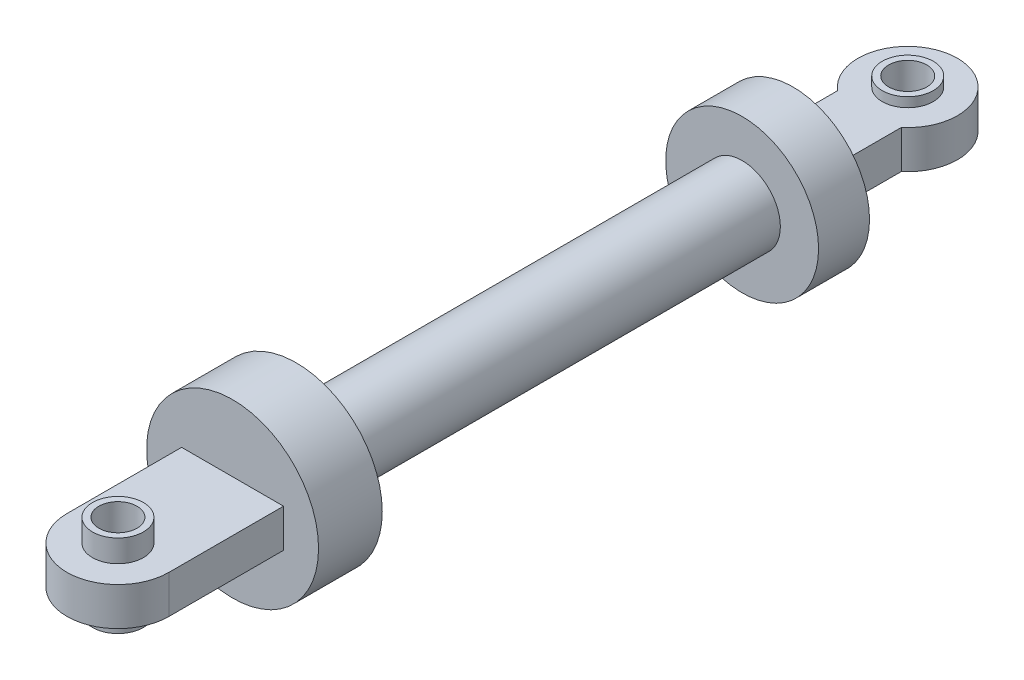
ISO-10303-21;
HEADER;
FILE_DESCRIPTION(('STEP AP214'),'2;1');
FILE_NAME('part.step','',(''),(''),'','','');
FILE_SCHEMA(('AUTOMOTIVE_DESIGN { 1 0 10303 214 1 1 1 1 }'));
ENDSEC;
DATA;
#1=APPLICATION_CONTEXT('core data for automotive mechanical design processes');
#2=APPLICATION_PROTOCOL_DEFINITION('international standard','automotive_design',2000,#1);
#3=PRODUCT_CONTEXT('',#1,'mechanical');
#4=PRODUCT('Part','Part','',(#3));
#5=PRODUCT_RELATED_PRODUCT_CATEGORY('part','',(#4));
#6=PRODUCT_DEFINITION_FORMATION('','',#4);
#7=PRODUCT_DEFINITION_CONTEXT('part definition',#1,'design');
#8=PRODUCT_DEFINITION('design','',#6,#7);
#9=PRODUCT_DEFINITION_SHAPE('','',#8);
#10=(LENGTH_UNIT() NAMED_UNIT(*) SI_UNIT(.MILLI.,.METRE.));
#11=(NAMED_UNIT(*) PLANE_ANGLE_UNIT() SI_UNIT($,.RADIAN.));
#12=(NAMED_UNIT(*) SI_UNIT($,.STERADIAN.) SOLID_ANGLE_UNIT());
#13=UNCERTAINTY_MEASURE_WITH_UNIT(LENGTH_MEASURE(1.E-05),#10,'distance_accuracy_value','');
#14=(GEOMETRIC_REPRESENTATION_CONTEXT(3) GLOBAL_UNCERTAINTY_ASSIGNED_CONTEXT((#13)) GLOBAL_UNIT_ASSIGNED_CONTEXT((#10,
#11,#12)) REPRESENTATION_CONTEXT('',''));
#15=CARTESIAN_POINT('',(0.,0.,0.));
#16=DIRECTION('',(0.,0.,1.));
#17=DIRECTION('',(1.,0.,0.));
#18=AXIS2_PLACEMENT_3D('',#15,#16,#17);
#19=CARTESIAN_POINT('',(0.,1.5,53.));
#20=DIRECTION('',(0.,1.,0.));
#21=DIRECTION('',(0.,0.,1.));
#22=AXIS2_PLACEMENT_3D('',#19,#20,#21);
#23=PLANE('',#22);
#24=DIRECTION('',(0.,0.,-1.));
#25=VECTOR('',#24,1.);
#26=CARTESIAN_POINT('',(4.,1.5,44.));
#27=LINE('',#26,#25);
#28=CARTESIAN_POINT('',(4.,1.5,53.));
#29=VERTEX_POINT('',#28);
#30=CARTESIAN_POINT('',(4.,1.5,44.));
#31=VERTEX_POINT('',#30);
#32=EDGE_CURVE('E98',#29,#31,#27,.T.);
#33=ORIENTED_EDGE('',*,*,#32,.T.);
#34=DIRECTION('',(-1.,0.,0.));
#35=VECTOR('',#34,1.);
#36=CARTESIAN_POINT('',(4.,1.5,44.));
#37=LINE('',#36,#35);
#38=CARTESIAN_POINT('',(-4.,1.5,44.));
#39=VERTEX_POINT('',#38);
#40=EDGE_CURVE('E102',#31,#39,#37,.T.);
#41=ORIENTED_EDGE('',*,*,#40,.T.);
#42=DIRECTION('',(0.,0.,1.));
#43=VECTOR('',#42,1.);
#44=CARTESIAN_POINT('',(-4.,1.5,44.));
#45=LINE('',#44,#43);
#46=CARTESIAN_POINT('',(-4.,1.5,53.));
#47=VERTEX_POINT('',#46);
#48=EDGE_CURVE('E49',#39,#47,#45,.T.);
#49=ORIENTED_EDGE('',*,*,#48,.T.);
#50=CARTESIAN_POINT('',(0.,1.5,53.));
#51=DIRECTION('',(0.,1.,0.));
#52=DIRECTION('',(0.,0.,1.));
#53=AXIS2_PLACEMENT_3D('',#50,#51,#52);
#54=CIRCLE('',#53,4.);
#55=EDGE_CURVE('E105',#47,#29,#54,.T.);
#56=ORIENTED_EDGE('',*,*,#55,.T.);
#57=EDGE_LOOP('',(#33,#41,#49,#56));
#58=FACE_BOUND('',#57,.T.);
#59=CARTESIAN_POINT('',(0.,1.5,53.));
#60=DIRECTION('',(0.,1.,0.));
#61=DIRECTION('',(0.,0.,1.));
#62=AXIS2_PLACEMENT_3D('',#59,#60,#61);
#63=CIRCLE('',#62,2.);
#64=CARTESIAN_POINT('',(0.,1.5,51.));
#65=VERTEX_POINT('',#64);
#66=EDGE_CURVE('E177',#65,#65,#63,.T.);
#67=ORIENTED_EDGE('',*,*,#66,.F.);
#68=EDGE_LOOP('',(#67));
#69=FACE_BOUND('',#68,.T.);
#70=ADVANCED_FACE('F34',(#58,#69),#23,.T.);
#71=CARTESIAN_POINT('',(0.,1.5,-9.));
#72=DIRECTION('',(0.,1.,0.));
#73=DIRECTION('',(0.,0.,1.));
#74=AXIS2_PLACEMENT_3D('',#71,#72,#73);
#75=PLANE('',#74);
#76=DIRECTION('',(0.,0.,1.));
#77=VECTOR('',#76,1.);
#78=CARTESIAN_POINT('',(-2.5,1.5,0.));
#79=LINE('',#78,#77);
#80=CARTESIAN_POINT('',(-2.5,1.5,-6.));
#81=VERTEX_POINT('',#80);
#82=CARTESIAN_POINT('',(-2.5,1.5,0.));
#83=VERTEX_POINT('',#82);
#84=EDGE_CURVE('E141',#81,#83,#79,.T.);
#85=ORIENTED_EDGE('',*,*,#84,.T.);
#86=DIRECTION('',(1.,0.,0.));
#87=VECTOR('',#86,1.);
#88=CARTESIAN_POINT('',(-2.5,1.5,0.));
#89=LINE('',#88,#87);
#90=CARTESIAN_POINT('',(2.5,1.5,0.));
#91=VERTEX_POINT('',#90);
#92=EDGE_CURVE('E57',#83,#91,#89,.T.);
#93=ORIENTED_EDGE('',*,*,#92,.T.);
#94=DIRECTION('',(0.,0.,-1.));
#95=VECTOR('',#94,1.);
#96=CARTESIAN_POINT('',(2.5,1.5,0.));
#97=LINE('',#96,#95);
#98=CARTESIAN_POINT('',(2.5,1.5,-6.));
#99=VERTEX_POINT('',#98);
#100=EDGE_CURVE('E145',#91,#99,#97,.T.);
#101=ORIENTED_EDGE('',*,*,#100,.T.);
#102=CARTESIAN_POINT('',(0.,1.5,-9.));
#103=DIRECTION('',(0.,1.,0.));
#104=DIRECTION('',(0.,0.,1.));
#105=AXIS2_PLACEMENT_3D('',#102,#103,#104);
#106=CIRCLE('',#105,3.90512483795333);
#107=EDGE_CURVE('E147',#99,#81,#106,.T.);
#108=ORIENTED_EDGE('',*,*,#107,.T.);
#109=EDGE_LOOP('',(#85,#93,#101,#108));
#110=FACE_BOUND('',#109,.T.);
#111=CARTESIAN_POINT('',(0.,1.5,-9.));
#112=DIRECTION('',(0.,1.,0.));
#113=DIRECTION('',(0.,0.,1.));
#114=AXIS2_PLACEMENT_3D('',#111,#112,#113);
#115=CIRCLE('',#114,2.);
#116=CARTESIAN_POINT('',(0.,1.5,-11.));
#117=VERTEX_POINT('',#116);
#118=EDGE_CURVE('E229',#117,#117,#115,.T.);
#119=ORIENTED_EDGE('',*,*,#118,.F.);
#120=EDGE_LOOP('',(#119));
#121=FACE_BOUND('',#120,.T.);
#122=ADVANCED_FACE('F222',(#110,#121),#75,.T.);
#123=CARTESIAN_POINT('',(0.,0.,4.));
#124=DIRECTION('',(0.,0.,1.));
#125=DIRECTION('',(1.,0.,0.));
#126=AXIS2_PLACEMENT_3D('',#123,#124,#125);
#127=PLANE('',#126);
#128=CARTESIAN_POINT('',(0.,0.,4.));
#129=DIRECTION('',(0.,0.,1.));
#130=DIRECTION('',(1.,0.,0.));
#131=AXIS2_PLACEMENT_3D('',#128,#129,#130);
#132=CIRCLE('',#131,3.);
#133=CARTESIAN_POINT('',(3.,0.,4.));
#134=VERTEX_POINT('',#133);
#135=EDGE_CURVE('E173',#134,#134,#132,.T.);
#136=ORIENTED_EDGE('',*,*,#135,.F.);
#137=EDGE_LOOP('',(#136));
#138=FACE_BOUND('',#137,.T.);
#139=CARTESIAN_POINT('',(0.,0.,4.));
#140=DIRECTION('',(0.,0.,1.));
#141=DIRECTION('',(1.,0.,0.));
#142=AXIS2_PLACEMENT_3D('',#139,#140,#141);
#143=CIRCLE('',#142,6.);
#144=CARTESIAN_POINT('',(6.,0.,4.));
#145=VERTEX_POINT('',#144);
#146=EDGE_CURVE('E231',#145,#145,#143,.T.);
#147=ORIENTED_EDGE('',*,*,#146,.T.);
#148=EDGE_LOOP('',(#147));
#149=FACE_BOUND('',#148,.T.);
#150=ADVANCED_FACE('F225',(#138,#149),#127,.T.);
#151=CARTESIAN_POINT('',(0.,0.,39.));
#152=DIRECTION('',(0.,0.,1.));
#153=DIRECTION('',(1.,0.,0.));
#154=AXIS2_PLACEMENT_3D('',#151,#152,#153);
#155=PLANE('',#154);
#156=CARTESIAN_POINT('',(0.,0.,39.));
#157=DIRECTION('',(0.,0.,1.));
#158=DIRECTION('',(1.,0.,0.));
#159=AXIS2_PLACEMENT_3D('',#156,#157,#158);
#160=CIRCLE('',#159,3.);
#161=CARTESIAN_POINT('',(3.,0.,39.));
#162=VERTEX_POINT('',#161);
#163=EDGE_CURVE('E242',#162,#162,#160,.T.);
#164=ORIENTED_EDGE('',*,*,#163,.T.);
#165=EDGE_LOOP('',(#164));
#166=FACE_BOUND('',#165,.T.);
#167=CARTESIAN_POINT('',(0.,0.,39.));
#168=DIRECTION('',(0.,0.,1.));
#169=DIRECTION('',(1.,0.,0.));
#170=AXIS2_PLACEMENT_3D('',#167,#168,#169);
#171=CIRCLE('',#170,6.75);
#172=CARTESIAN_POINT('',(6.75,0.,39.));
#173=VERTEX_POINT('',#172);
#174=EDGE_CURVE('E131',#173,#173,#171,.T.);
#175=ORIENTED_EDGE('',*,*,#174,.F.);
#176=EDGE_LOOP('',(#175));
#177=FACE_BOUND('',#176,.T.);
#178=ADVANCED_FACE('F247',(#166,#177),#155,.F.);
#179=CARTESIAN_POINT('',(0.,0.,4.));
#180=DIRECTION('',(0.,0.,1.));
#181=DIRECTION('',(1.,0.,0.));
#182=AXIS2_PLACEMENT_3D('',#179,#180,#181);
#183=CYLINDRICAL_SURFACE('',#182,3.);
#184=ORIENTED_EDGE('',*,*,#135,.T.);
#185=EDGE_LOOP('',(#184));
#186=FACE_BOUND('',#185,.T.);
#187=ORIENTED_EDGE('',*,*,#163,.F.);
#188=EDGE_LOOP('',(#187));
#189=FACE_BOUND('',#188,.T.);
#190=ADVANCED_FACE('F250',(#186,#189),#183,.T.);
#191=CARTESIAN_POINT('',(0.,1.5,53.));
#192=DIRECTION('',(0.,-1.,0.));
#193=DIRECTION('',(0.,0.,-1.));
#194=AXIS2_PLACEMENT_3D('',#191,#192,#193);
#195=CYLINDRICAL_SURFACE('',#194,1.5);
#196=CARTESIAN_POINT('',(0.,-3.25,53.));
#197=DIRECTION('',(0.,1.,0.));
#198=DIRECTION('',(0.,0.,1.));
#199=AXIS2_PLACEMENT_3D('',#196,#197,#198);
#200=CIRCLE('',#199,1.5);
#201=CARTESIAN_POINT('',(0.,-3.25,54.5));
#202=VERTEX_POINT('',#201);
#203=EDGE_CURVE('E511',#202,#202,#200,.T.);
#204=ORIENTED_EDGE('',*,*,#203,.F.);
#205=EDGE_LOOP('',(#204));
#206=FACE_BOUND('',#205,.T.);
#207=CARTESIAN_POINT('',(0.,3.25,53.));
#208=DIRECTION('',(0.,-1.,0.));
#209=DIRECTION('',(0.,0.,-1.));
#210=AXIS2_PLACEMENT_3D('',#207,#208,#209);
#211=CIRCLE('',#210,1.5);
#212=CARTESIAN_POINT('',(0.,3.25,51.5));
#213=VERTEX_POINT('',#212);
#214=EDGE_CURVE('E181',#213,#213,#211,.T.);
#215=ORIENTED_EDGE('',*,*,#214,.F.);
#216=EDGE_LOOP('',(#215));
#217=FACE_BOUND('',#216,.T.);
#218=ADVANCED_FACE('F252',(#206,#217),#195,.F.);
#219=CARTESIAN_POINT('',(0.,1.5,53.));
#220=DIRECTION('',(0.,-1.,0.));
#221=DIRECTION('',(0.,0.,-1.));
#222=AXIS2_PLACEMENT_3D('',#219,#220,#221);
#223=CYLINDRICAL_SURFACE('',#222,4.);
#224=CARTESIAN_POINT('',(0.,-1.5,53.));
#225=DIRECTION('',(0.,1.,0.));
#226=DIRECTION('',(0.,0.,1.));
#227=AXIS2_PLACEMENT_3D('',#224,#225,#226);
#228=CIRCLE('',#227,4.);
#229=CARTESIAN_POINT('',(-4.,-1.5,53.));
#230=VERTEX_POINT('',#229);
#231=CARTESIAN_POINT('',(4.,-1.5,53.));
#232=VERTEX_POINT('',#231);
#233=EDGE_CURVE('E109',#230,#232,#228,.T.);
#234=ORIENTED_EDGE('',*,*,#233,.T.);
#235=DIRECTION('',(0.,-1.,0.));
#236=VECTOR('',#235,1.);
#237=CARTESIAN_POINT('',(4.,1.5,53.));
#238=LINE('',#237,#236);
#239=EDGE_CURVE('E128',#29,#232,#238,.T.);
#240=ORIENTED_EDGE('',*,*,#239,.F.);
#241=ORIENTED_EDGE('',*,*,#55,.F.);
#242=DIRECTION('',(0.,-1.,0.));
#243=VECTOR('',#242,1.);
#244=CARTESIAN_POINT('',(-4.,1.5,53.));
#245=LINE('',#244,#243);
#246=EDGE_CURVE('E137',#47,#230,#245,.T.);
#247=ORIENTED_EDGE('',*,*,#246,.T.);
#248=EDGE_LOOP('',(#234,#240,#241,#247));
#249=FACE_BOUND('',#248,.T.);
#250=ADVANCED_FACE('F259',(#249),#223,.T.);
#251=CARTESIAN_POINT('',(-4.,1.5,44.));
#252=DIRECTION('',(1.,0.,0.));
#253=DIRECTION('',(0.,0.,-1.));
#254=AXIS2_PLACEMENT_3D('',#251,#252,#253);
#255=PLANE('',#254);
#256=DIRECTION('',(0.,0.,1.));
#257=VECTOR('',#256,1.);
#258=CARTESIAN_POINT('',(-4.,-1.5,44.));
#259=LINE('',#258,#257);
#260=CARTESIAN_POINT('',(-4.,-1.5,44.));
#261=VERTEX_POINT('',#260);
#262=EDGE_CURVE('E133',#261,#230,#259,.T.);
#263=ORIENTED_EDGE('',*,*,#262,.T.);
#264=ORIENTED_EDGE('',*,*,#246,.F.);
#265=ORIENTED_EDGE('',*,*,#48,.F.);
#266=DIRECTION('',(0.,-1.,0.));
#267=VECTOR('',#266,1.);
#268=CARTESIAN_POINT('',(-4.,1.5,44.));
#269=LINE('',#268,#267);
#270=EDGE_CURVE('E120',#39,#261,#269,.T.);
#271=ORIENTED_EDGE('',*,*,#270,.T.);
#272=EDGE_LOOP('',(#263,#264,#265,#271));
#273=FACE_BOUND('',#272,.T.);
#274=ADVANCED_FACE('F273',(#273),#255,.F.);
#275=CARTESIAN_POINT('',(0.,-1.5,53.));
#276=DIRECTION('',(0.,1.,0.));
#277=DIRECTION('',(0.,0.,1.));
#278=AXIS2_PLACEMENT_3D('',#275,#276,#277);
#279=PLANE('',#278);
#280=CARTESIAN_POINT('',(0.,-1.5,53.));
#281=DIRECTION('',(0.,1.,0.));
#282=DIRECTION('',(0.,0.,1.));
#283=AXIS2_PLACEMENT_3D('',#280,#281,#282);
#284=CIRCLE('',#283,2.);
#285=CARTESIAN_POINT('',(0.,-1.5,55.));
#286=VERTEX_POINT('',#285);
#287=EDGE_CURVE('E178',#286,#286,#284,.T.);
#288=ORIENTED_EDGE('',*,*,#287,.T.);
#289=EDGE_LOOP('',(#288));
#290=FACE_BOUND('',#289,.T.);
#291=DIRECTION('',(0.,0.,-1.));
#292=VECTOR('',#291,1.);
#293=CARTESIAN_POINT('',(4.,-1.5,44.));
#294=LINE('',#293,#292);
#295=CARTESIAN_POINT('',(4.,-1.5,44.));
#296=VERTEX_POINT('',#295);
#297=EDGE_CURVE('E116',#232,#296,#294,.T.);
#298=ORIENTED_EDGE('',*,*,#297,.F.);
#299=ORIENTED_EDGE('',*,*,#233,.F.);
#300=ORIENTED_EDGE('',*,*,#262,.F.);
#301=DIRECTION('',(-1.,0.,0.));
#302=VECTOR('',#301,1.);
#303=CARTESIAN_POINT('',(4.,-1.5,44.));
#304=LINE('',#303,#302);
#305=EDGE_CURVE('E130',#296,#261,#304,.T.);
#306=ORIENTED_EDGE('',*,*,#305,.F.);
#307=EDGE_LOOP('',(#298,#299,#300,#306));
#308=FACE_BOUND('',#307,.T.);
#309=ADVANCED_FACE('F270',(#290,#308),#279,.F.);
#310=CARTESIAN_POINT('',(4.,1.5,44.));
#311=DIRECTION('',(-1.,0.,0.));
#312=DIRECTION('',(0.,0.,1.));
#313=AXIS2_PLACEMENT_3D('',#310,#311,#312);
#314=PLANE('',#313);
#315=ORIENTED_EDGE('',*,*,#297,.T.);
#316=DIRECTION('',(0.,-1.,0.));
#317=VECTOR('',#316,1.);
#318=CARTESIAN_POINT('',(4.,1.5,44.));
#319=LINE('',#318,#317);
#320=EDGE_CURVE('E113',#31,#296,#319,.T.);
#321=ORIENTED_EDGE('',*,*,#320,.F.);
#322=ORIENTED_EDGE('',*,*,#32,.F.);
#323=ORIENTED_EDGE('',*,*,#239,.T.);
#324=EDGE_LOOP('',(#315,#321,#322,#323));
#325=FACE_BOUND('',#324,.T.);
#326=ADVANCED_FACE('F114',(#325),#314,.F.);
#327=CARTESIAN_POINT('',(0.,0.,44.));
#328=DIRECTION('',(0.,0.,1.));
#329=DIRECTION('',(1.,0.,0.));
#330=AXIS2_PLACEMENT_3D('',#327,#328,#329);
#331=PLANE('',#330);
#332=CARTESIAN_POINT('',(0.,0.,44.));
#333=DIRECTION('',(0.,0.,1.));
#334=DIRECTION('',(1.,0.,0.));
#335=AXIS2_PLACEMENT_3D('',#332,#333,#334);
#336=CIRCLE('',#335,6.75);
#337=CARTESIAN_POINT('',(6.75,0.,44.));
#338=VERTEX_POINT('',#337);
#339=EDGE_CURVE('E167',#338,#338,#336,.T.);
#340=ORIENTED_EDGE('',*,*,#339,.T.);
#341=EDGE_LOOP('',(#340));
#342=FACE_BOUND('',#341,.T.);
#343=ORIENTED_EDGE('',*,*,#40,.F.);
#344=ORIENTED_EDGE('',*,*,#320,.T.);
#345=ORIENTED_EDGE('',*,*,#305,.T.);
#346=ORIENTED_EDGE('',*,*,#270,.F.);
#347=EDGE_LOOP('',(#343,#344,#345,#346));
#348=FACE_BOUND('',#347,.T.);
#349=ADVANCED_FACE('F122',(#342,#348),#331,.T.);
#350=CARTESIAN_POINT('',(0.,0.,44.));
#351=DIRECTION('',(0.,0.,-1.));
#352=DIRECTION('',(-1.,0.,0.));
#353=AXIS2_PLACEMENT_3D('',#350,#351,#352);
#354=CYLINDRICAL_SURFACE('',#353,6.75);
#355=ORIENTED_EDGE('',*,*,#174,.T.);
#356=EDGE_LOOP('',(#355));
#357=FACE_BOUND('',#356,.T.);
#358=ORIENTED_EDGE('',*,*,#339,.F.);
#359=EDGE_LOOP('',(#358));
#360=FACE_BOUND('',#359,.T.);
#361=ADVANCED_FACE('F36',(#357,#360),#354,.T.);
#362=CARTESIAN_POINT('',(0.,0.,-16.));
#363=DIRECTION('',(0.,0.,1.));
#364=DIRECTION('',(1.,0.,0.));
#365=AXIS2_PLACEMENT_3D('',#362,#363,#364);
#366=CYLINDRICAL_SURFACE('',#365,6.);
#367=ORIENTED_EDGE('',*,*,#146,.F.);
#368=EDGE_LOOP('',(#367));
#369=FACE_BOUND('',#368,.T.);
#370=CARTESIAN_POINT('',(0.,0.,0.));
#371=DIRECTION('',(0.,0.,1.));
#372=DIRECTION('',(1.,0.,0.));
#373=AXIS2_PLACEMENT_3D('',#370,#371,#372);
#374=CIRCLE('',#373,6.);
#375=CARTESIAN_POINT('',(6.,0.,0.));
#376=VERTEX_POINT('',#375);
#377=EDGE_CURVE('E234',#376,#376,#374,.T.);
#378=ORIENTED_EDGE('',*,*,#377,.T.);
#379=EDGE_LOOP('',(#378));
#380=FACE_BOUND('',#379,.T.);
#381=ADVANCED_FACE('F289',(#369,#380),#366,.T.);
#382=CARTESIAN_POINT('',(0.,1.5,-9.));
#383=DIRECTION('',(0.,-1.,0.));
#384=DIRECTION('',(0.,0.,-1.));
#385=AXIS2_PLACEMENT_3D('',#382,#383,#384);
#386=CYLINDRICAL_SURFACE('',#385,3.90512483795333);
#387=CARTESIAN_POINT('',(0.,-1.5,-9.));
#388=DIRECTION('',(0.,1.,0.));
#389=DIRECTION('',(0.,0.,1.));
#390=AXIS2_PLACEMENT_3D('',#387,#388,#389);
#391=CIRCLE('',#390,3.90512483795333);
#392=CARTESIAN_POINT('',(2.5,-1.5,-6.));
#393=VERTEX_POINT('',#392);
#394=CARTESIAN_POINT('',(-2.5,-1.5,-6.));
#395=VERTEX_POINT('',#394);
#396=EDGE_CURVE('E143',#393,#395,#391,.T.);
#397=ORIENTED_EDGE('',*,*,#396,.T.);
#398=DIRECTION('',(0.,-1.,0.));
#399=VECTOR('',#398,1.);
#400=CARTESIAN_POINT('',(-2.5,1.5,-6.));
#401=LINE('',#400,#399);
#402=EDGE_CURVE('E149',#81,#395,#401,.T.);
#403=ORIENTED_EDGE('',*,*,#402,.F.);
#404=ORIENTED_EDGE('',*,*,#107,.F.);
#405=DIRECTION('',(0.,-1.,0.));
#406=VECTOR('',#405,1.);
#407=CARTESIAN_POINT('',(2.5,1.5,-6.));
#408=LINE('',#407,#406);
#409=EDGE_CURVE('E159',#99,#393,#408,.T.);
#410=ORIENTED_EDGE('',*,*,#409,.T.);
#411=EDGE_LOOP('',(#397,#403,#404,#410));
#412=FACE_BOUND('',#411,.T.);
#413=ADVANCED_FACE('F215',(#412),#386,.T.);
#414=CARTESIAN_POINT('',(2.5,1.5,0.));
#415=DIRECTION('',(-1.,0.,0.));
#416=DIRECTION('',(0.,0.,1.));
#417=AXIS2_PLACEMENT_3D('',#414,#415,#416);
#418=PLANE('',#417);
#419=DIRECTION('',(0.,0.,-1.));
#420=VECTOR('',#419,1.);
#421=CARTESIAN_POINT('',(2.5,-1.5,0.));
#422=LINE('',#421,#420);
#423=CARTESIAN_POINT('',(2.5,-1.5,0.));
#424=VERTEX_POINT('',#423);
#425=EDGE_CURVE('E154',#424,#393,#422,.T.);
#426=ORIENTED_EDGE('',*,*,#425,.T.);
#427=ORIENTED_EDGE('',*,*,#409,.F.);
#428=ORIENTED_EDGE('',*,*,#100,.F.);
#429=DIRECTION('',(0.,-1.,0.));
#430=VECTOR('',#429,1.);
#431=CARTESIAN_POINT('',(2.5,1.5,0.));
#432=LINE('',#431,#430);
#433=EDGE_CURVE('E162',#91,#424,#432,.T.);
#434=ORIENTED_EDGE('',*,*,#433,.T.);
#435=EDGE_LOOP('',(#426,#427,#428,#434));
#436=FACE_BOUND('',#435,.T.);
#437=ADVANCED_FACE('F203',(#436),#418,.F.);
#438=CARTESIAN_POINT('',(0.,-1.5,-9.));
#439=DIRECTION('',(0.,1.,0.));
#440=DIRECTION('',(0.,0.,1.));
#441=AXIS2_PLACEMENT_3D('',#438,#439,#440);
#442=PLANE('',#441);
#443=CARTESIAN_POINT('',(0.,-1.5,-9.));
#444=DIRECTION('',(0.,1.,0.));
#445=DIRECTION('',(0.,0.,1.));
#446=AXIS2_PLACEMENT_3D('',#443,#444,#445);
#447=CIRCLE('',#446,2.);
#448=CARTESIAN_POINT('',(0.,-1.5,-7.));
#449=VERTEX_POINT('',#448);
#450=EDGE_CURVE('E174',#449,#449,#447,.T.);
#451=ORIENTED_EDGE('',*,*,#450,.T.);
#452=EDGE_LOOP('',(#451));
#453=FACE_BOUND('',#452,.T.);
#454=DIRECTION('',(0.,0.,1.));
#455=VECTOR('',#454,1.);
#456=CARTESIAN_POINT('',(-2.5,-1.5,0.));
#457=LINE('',#456,#455);
#458=CARTESIAN_POINT('',(-2.5,-1.5,0.));
#459=VERTEX_POINT('',#458);
#460=EDGE_CURVE('E119',#395,#459,#457,.T.);
#461=ORIENTED_EDGE('',*,*,#460,.F.);
#462=ORIENTED_EDGE('',*,*,#396,.F.);
#463=ORIENTED_EDGE('',*,*,#425,.F.);
#464=DIRECTION('',(1.,0.,0.));
#465=VECTOR('',#464,1.);
#466=CARTESIAN_POINT('',(-2.5,-1.5,0.));
#467=LINE('',#466,#465);
#468=EDGE_CURVE('E152',#459,#424,#467,.T.);
#469=ORIENTED_EDGE('',*,*,#468,.F.);
#470=EDGE_LOOP('',(#461,#462,#463,#469));
#471=FACE_BOUND('',#470,.T.);
#472=ADVANCED_FACE('F199',(#453,#471),#442,.F.);
#473=CARTESIAN_POINT('',(-2.5,1.5,0.));
#474=DIRECTION('',(1.,0.,0.));
#475=DIRECTION('',(0.,0.,-1.));
#476=AXIS2_PLACEMENT_3D('',#473,#474,#475);
#477=PLANE('',#476);
#478=ORIENTED_EDGE('',*,*,#460,.T.);
#479=DIRECTION('',(0.,-1.,0.));
#480=VECTOR('',#479,1.);
#481=CARTESIAN_POINT('',(-2.5,1.5,0.));
#482=LINE('',#481,#480);
#483=EDGE_CURVE('E165',#83,#459,#482,.T.);
#484=ORIENTED_EDGE('',*,*,#483,.F.);
#485=ORIENTED_EDGE('',*,*,#84,.F.);
#486=ORIENTED_EDGE('',*,*,#402,.T.);
#487=EDGE_LOOP('',(#478,#484,#485,#486));
#488=FACE_BOUND('',#487,.T.);
#489=ADVANCED_FACE('F202',(#488),#477,.F.);
#490=CARTESIAN_POINT('',(0.,0.,0.));
#491=DIRECTION('',(0.,0.,1.));
#492=DIRECTION('',(1.,0.,0.));
#493=AXIS2_PLACEMENT_3D('',#490,#491,#492);
#494=PLANE('',#493);
#495=ORIENTED_EDGE('',*,*,#483,.T.);
#496=ORIENTED_EDGE('',*,*,#468,.T.);
#497=ORIENTED_EDGE('',*,*,#433,.F.);
#498=ORIENTED_EDGE('',*,*,#92,.F.);
#499=EDGE_LOOP('',(#495,#496,#497,#498));
#500=FACE_BOUND('',#499,.T.);
#501=ORIENTED_EDGE('',*,*,#377,.F.);
#502=EDGE_LOOP('',(#501));
#503=FACE_BOUND('',#502,.T.);
#504=ADVANCED_FACE('F219',(#500,#503),#494,.F.);
#505=CARTESIAN_POINT('',(0.,3.65,-9.));
#506=DIRECTION('',(0.,-1.,0.));
#507=DIRECTION('',(0.,0.,-1.));
#508=AXIS2_PLACEMENT_3D('',#505,#506,#507);
#509=CYLINDRICAL_SURFACE('',#508,2.);
#510=CARTESIAN_POINT('',(0.,2.25000000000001,-9.));
#511=DIRECTION('',(0.,-1.,0.));
#512=DIRECTION('',(0.,0.,-1.));
#513=AXIS2_PLACEMENT_3D('',#510,#511,#512);
#514=CIRCLE('',#513,2.);
#515=CARTESIAN_POINT('',(0.,2.25000000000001,-11.));
#516=VERTEX_POINT('',#515);
#517=EDGE_CURVE('E11',#516,#516,#514,.T.);
#518=CARTESIAN_POINT('',(0.,2.25000000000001,-11.));
#519=CARTESIAN_POINT('',(0.,2.24218750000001,-11.));
#520=CARTESIAN_POINT('',(0.,2.23437500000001,-11.));
#521=CARTESIAN_POINT('',(0.,2.21875000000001,-11.));
#522=CARTESIAN_POINT('',(0.,2.21093750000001,-11.));
#523=CARTESIAN_POINT('',(0.,2.19531250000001,-11.));
#524=CARTESIAN_POINT('',(0.,2.18750000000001,-11.));
#525=CARTESIAN_POINT('',(0.,2.17187500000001,-11.));
#526=CARTESIAN_POINT('',(0.,2.16406250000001,-11.));
#527=CARTESIAN_POINT('',(0.,2.14843750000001,-11.));
#528=CARTESIAN_POINT('',(0.,2.14062500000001,-11.));
#529=CARTESIAN_POINT('',(0.,2.12500000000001,-11.));
#530=CARTESIAN_POINT('',(0.,2.11718750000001,-11.));
#531=CARTESIAN_POINT('',(0.,2.10156250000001,-11.));
#532=CARTESIAN_POINT('',(0.,2.09375000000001,-11.));
#533=CARTESIAN_POINT('',(0.,2.07812500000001,-11.));
#534=CARTESIAN_POINT('',(0.,2.07031250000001,-11.));
#535=CARTESIAN_POINT('',(0.,2.05468750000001,-11.));
#536=CARTESIAN_POINT('',(0.,2.04687500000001,-11.));
#537=CARTESIAN_POINT('',(0.,2.03125000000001,-11.));
#538=CARTESIAN_POINT('',(0.,2.02343750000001,-11.));
#539=CARTESIAN_POINT('',(0.,2.00781250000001,-11.));
#540=CARTESIAN_POINT('',(0.,2.00000000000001,-11.));
#541=CARTESIAN_POINT('',(0.,1.984375,-11.));
#542=CARTESIAN_POINT('',(0.,1.9765625,-11.));
#543=CARTESIAN_POINT('',(0.,1.9609375,-11.));
#544=CARTESIAN_POINT('',(0.,1.953125,-11.));
#545=CARTESIAN_POINT('',(0.,1.9375,-11.));
#546=CARTESIAN_POINT('',(0.,1.9296875,-11.));
#547=CARTESIAN_POINT('',(0.,1.9140625,-11.));
#548=CARTESIAN_POINT('',(0.,1.90625,-11.));
#549=CARTESIAN_POINT('',(0.,1.890625,-11.));
#550=CARTESIAN_POINT('',(0.,1.8828125,-11.));
#551=CARTESIAN_POINT('',(0.,1.8671875,-11.));
#552=CARTESIAN_POINT('',(0.,1.859375,-11.));
#553=CARTESIAN_POINT('',(0.,1.84375,-11.));
#554=CARTESIAN_POINT('',(0.,1.8359375,-11.));
#555=CARTESIAN_POINT('',(0.,1.8203125,-11.));
#556=CARTESIAN_POINT('',(0.,1.8125,-11.));
#557=CARTESIAN_POINT('',(0.,1.796875,-11.));
#558=CARTESIAN_POINT('',(0.,1.7890625,-11.));
#559=CARTESIAN_POINT('',(0.,1.7734375,-11.));
#560=CARTESIAN_POINT('',(0.,1.765625,-11.));
#561=CARTESIAN_POINT('',(0.,1.75,-11.));
#562=CARTESIAN_POINT('',(0.,1.7421875,-11.));
#563=CARTESIAN_POINT('',(0.,1.7265625,-11.));
#564=CARTESIAN_POINT('',(0.,1.71875,-11.));
#565=CARTESIAN_POINT('',(0.,1.703125,-11.));
#566=CARTESIAN_POINT('',(0.,1.6953125,-11.));
#567=CARTESIAN_POINT('',(0.,1.6796875,-11.));
#568=CARTESIAN_POINT('',(0.,1.671875,-11.));
#569=CARTESIAN_POINT('',(0.,1.65625,-11.));
#570=CARTESIAN_POINT('',(0.,1.6484375,-11.));
#571=CARTESIAN_POINT('',(0.,1.6328125,-11.));
#572=CARTESIAN_POINT('',(0.,1.625,-11.));
#573=CARTESIAN_POINT('',(0.,1.609375,-11.));
#574=CARTESIAN_POINT('',(0.,1.6015625,-11.));
#575=CARTESIAN_POINT('',(0.,1.5859375,-11.));
#576=CARTESIAN_POINT('',(0.,1.578125,-11.));
#577=CARTESIAN_POINT('',(0.,1.5625,-11.));
#578=CARTESIAN_POINT('',(0.,1.5546875,-11.));
#579=CARTESIAN_POINT('',(0.,1.5390625,-11.));
#580=CARTESIAN_POINT('',(0.,1.53125,-11.));
#581=CARTESIAN_POINT('',(0.,1.515625,-11.));
#582=CARTESIAN_POINT('',(0.,1.5078125,-11.));
#583=CARTESIAN_POINT('',(0.,1.5,-11.));
#584=B_SPLINE_CURVE_WITH_KNOTS('',3,(#518,#519,#520,#521,#522,#523,#524,#525,#526,#527,#528,
#529,#530,#531,#532,#533,#534,#535,#536,#537,#538,#539,#540,#541,#542,#543,#544,#545,#546,#547,
#548,#549,#550,#551,#552,#553,#554,#555,#556,#557,#558,#559,#560,#561,#562,#563,#564,#565,#566,
#567,#568,#569,#570,#571,#572,#573,#574,#575,#576,#577,#578,#579,#580,#581,#582,#583),
.UNSPECIFIED.,.F.,.F.,(4,2,2,2,2,2,2,2,2,2,2,2,2,2,2,2,2,2,2,2,2,2,2,2,2,2,2,2,2,2,2,2,4),(0.,
0.0234375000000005,0.0468750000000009,0.0703125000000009,0.0937500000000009,0.117187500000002,
0.140625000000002,0.164062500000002,0.187500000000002,0.210937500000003,0.234375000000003,
0.257812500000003,0.281250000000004,0.304687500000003,0.328125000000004,0.351562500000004,
0.375000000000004,0.398437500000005,0.421875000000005,0.445312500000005,0.468750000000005,
0.492187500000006,0.515625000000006,0.539062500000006,0.562500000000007,0.585937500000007,
0.609375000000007,0.632812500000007,0.656250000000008,0.679687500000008,0.703125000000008,
0.726562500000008,0.750000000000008),.UNSPECIFIED.);
#585=EDGE_CURVE('BSEAM297',#516,#117,#584,.T.);
#586=ORIENTED_EDGE('',*,*,#517,.T.);
#587=ORIENTED_EDGE('',*,*,#118,.T.);
#588=ORIENTED_EDGE('',*,*,#585,.T.);
#589=ORIENTED_EDGE('',*,*,#585,.F.);
#590=EDGE_LOOP('',(#586,#588,#587,#589));
#591=FACE_BOUND('',#590,.T.);
#592=ADVANCED_FACE('F297',(#591),#509,.T.);
#593=CARTESIAN_POINT('',(0.,3.65,53.));
#594=DIRECTION('',(0.,-1.,0.));
#595=DIRECTION('',(0.,0.,-1.));
#596=AXIS2_PLACEMENT_3D('',#593,#594,#595);
#597=CYLINDRICAL_SURFACE('',#596,2.);
#598=CARTESIAN_POINT('',(0.,3.25,53.));
#599=DIRECTION('',(0.,-1.,0.));
#600=DIRECTION('',(0.,0.,-1.));
#601=AXIS2_PLACEMENT_3D('',#598,#599,#600);
#602=CIRCLE('',#601,2.);
#603=CARTESIAN_POINT('',(0.,3.25,51.));
#604=VERTEX_POINT('',#603);
#605=EDGE_CURVE('E170',#604,#604,#602,.T.);
#606=CARTESIAN_POINT('',(0.,3.25,51.));
#607=CARTESIAN_POINT('',(0.,3.23177083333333,51.));
#608=CARTESIAN_POINT('',(0.,3.21354166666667,51.));
#609=CARTESIAN_POINT('',(0.,3.17708333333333,51.));
#610=CARTESIAN_POINT('',(0.,3.15885416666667,51.));
#611=CARTESIAN_POINT('',(0.,3.12239583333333,51.));
#612=CARTESIAN_POINT('',(0.,3.10416666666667,51.));
#613=CARTESIAN_POINT('',(0.,3.06770833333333,51.));
#614=CARTESIAN_POINT('',(0.,3.04947916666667,51.));
#615=CARTESIAN_POINT('',(0.,3.01302083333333,51.));
#616=CARTESIAN_POINT('',(0.,2.99479166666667,51.));
#617=CARTESIAN_POINT('',(0.,2.95833333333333,51.));
#618=CARTESIAN_POINT('',(0.,2.94010416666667,51.));
#619=CARTESIAN_POINT('',(0.,2.90364583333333,51.));
#620=CARTESIAN_POINT('',(0.,2.88541666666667,51.));
#621=CARTESIAN_POINT('',(0.,2.84895833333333,51.));
#622=CARTESIAN_POINT('',(0.,2.83072916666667,51.));
#623=CARTESIAN_POINT('',(0.,2.79427083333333,51.));
#624=CARTESIAN_POINT('',(0.,2.77604166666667,51.));
#625=CARTESIAN_POINT('',(0.,2.73958333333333,51.));
#626=CARTESIAN_POINT('',(0.,2.72135416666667,51.));
#627=CARTESIAN_POINT('',(0.,2.68489583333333,51.));
#628=CARTESIAN_POINT('',(0.,2.66666666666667,51.));
#629=CARTESIAN_POINT('',(0.,2.63020833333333,51.));
#630=CARTESIAN_POINT('',(0.,2.61197916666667,51.));
#631=CARTESIAN_POINT('',(0.,2.57552083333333,51.));
#632=CARTESIAN_POINT('',(0.,2.55729166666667,51.));
#633=CARTESIAN_POINT('',(0.,2.52083333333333,51.));
#634=CARTESIAN_POINT('',(0.,2.50260416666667,51.));
#635=CARTESIAN_POINT('',(0.,2.46614583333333,51.));
#636=CARTESIAN_POINT('',(0.,2.44791666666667,51.));
#637=CARTESIAN_POINT('',(0.,2.41145833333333,51.));
#638=CARTESIAN_POINT('',(0.,2.39322916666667,51.));
#639=CARTESIAN_POINT('',(0.,2.35677083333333,51.));
#640=CARTESIAN_POINT('',(0.,2.33854166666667,51.));
#641=CARTESIAN_POINT('',(0.,2.30208333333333,51.));
#642=CARTESIAN_POINT('',(0.,2.28385416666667,51.));
#643=CARTESIAN_POINT('',(0.,2.24739583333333,51.));
#644=CARTESIAN_POINT('',(0.,2.22916666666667,51.));
#645=CARTESIAN_POINT('',(0.,2.19270833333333,51.));
#646=CARTESIAN_POINT('',(0.,2.17447916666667,51.));
#647=CARTESIAN_POINT('',(0.,2.13802083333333,51.));
#648=CARTESIAN_POINT('',(0.,2.11979166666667,51.));
#649=CARTESIAN_POINT('',(0.,2.08333333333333,51.));
#650=CARTESIAN_POINT('',(0.,2.06510416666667,51.));
#651=CARTESIAN_POINT('',(0.,2.02864583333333,51.));
#652=CARTESIAN_POINT('',(0.,2.01041666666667,51.));
#653=CARTESIAN_POINT('',(0.,1.97395833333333,51.));
#654=CARTESIAN_POINT('',(0.,1.95572916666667,51.));
#655=CARTESIAN_POINT('',(0.,1.91927083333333,51.));
#656=CARTESIAN_POINT('',(0.,1.90104166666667,51.));
#657=CARTESIAN_POINT('',(0.,1.86458333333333,51.));
#658=CARTESIAN_POINT('',(0.,1.84635416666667,51.));
#659=CARTESIAN_POINT('',(0.,1.80989583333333,51.));
#660=CARTESIAN_POINT('',(0.,1.79166666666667,51.));
#661=CARTESIAN_POINT('',(0.,1.75520833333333,51.));
#662=CARTESIAN_POINT('',(0.,1.73697916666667,51.));
#663=CARTESIAN_POINT('',(0.,1.70052083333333,51.));
#664=CARTESIAN_POINT('',(0.,1.68229166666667,51.));
#665=CARTESIAN_POINT('',(0.,1.64583333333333,51.));
#666=CARTESIAN_POINT('',(0.,1.62760416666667,51.));
#667=CARTESIAN_POINT('',(0.,1.59114583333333,51.));
#668=CARTESIAN_POINT('',(0.,1.57291666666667,51.));
#669=CARTESIAN_POINT('',(0.,1.53645833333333,51.));
#670=CARTESIAN_POINT('',(0.,1.51822916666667,51.));
#671=CARTESIAN_POINT('',(0.,1.5,51.));
#672=B_SPLINE_CURVE_WITH_KNOTS('',3,(#606,#607,#608,#609,#610,#611,#612,#613,#614,#615,#616,
#617,#618,#619,#620,#621,#622,#623,#624,#625,#626,#627,#628,#629,#630,#631,#632,#633,#634,#635,
#636,#637,#638,#639,#640,#641,#642,#643,#644,#645,#646,#647,#648,#649,#650,#651,#652,#653,#654,
#655,#656,#657,#658,#659,#660,#661,#662,#663,#664,#665,#666,#667,#668,#669,#670,#671),
.UNSPECIFIED.,.F.,.F.,(4,2,2,2,2,2,2,2,2,2,2,2,2,2,2,2,2,2,2,2,2,2,2,2,2,2,2,2,2,2,2,2,4),(0.,
0.0546875,0.109375,0.1640625,0.21875,0.2734375,0.328125,0.3828125,0.4375,0.4921875,0.546875,
0.6015625,0.65625,0.7109375,0.765625,0.8203125,0.875,0.9296875,0.984375,1.0390625,1.09375,
1.1484375,1.203125,1.2578125,1.3125,1.3671875,1.421875,1.4765625,1.53125,1.5859375,1.640625,
1.6953125,1.75),.UNSPECIFIED.);
#673=EDGE_CURVE('BSEAM195',#604,#65,#672,.T.);
#674=ORIENTED_EDGE('',*,*,#605,.T.);
#675=ORIENTED_EDGE('',*,*,#66,.T.);
#676=ORIENTED_EDGE('',*,*,#673,.T.);
#677=ORIENTED_EDGE('',*,*,#673,.F.);
#678=EDGE_LOOP('',(#674,#676,#675,#677));
#679=FACE_BOUND('',#678,.T.);
#680=ADVANCED_FACE('F195',(#679),#597,.T.);
#681=CARTESIAN_POINT('',(0.,-3.65,-9.));
#682=DIRECTION('',(0.,1.,0.));
#683=DIRECTION('',(0.,0.,1.));
#684=AXIS2_PLACEMENT_3D('',#681,#682,#683);
#685=CYLINDRICAL_SURFACE('',#684,2.);
#686=CARTESIAN_POINT('',(0.,-2.24999999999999,-9.));
#687=DIRECTION('',(0.,1.,0.));
#688=DIRECTION('',(0.,0.,1.));
#689=AXIS2_PLACEMENT_3D('',#686,#687,#688);
#690=CIRCLE('',#689,2.);
#691=CARTESIAN_POINT('',(0.,-2.24999999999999,-7.));
#692=VERTEX_POINT('',#691);
#693=EDGE_CURVE('E42',#692,#692,#690,.F.);
#694=CARTESIAN_POINT('',(0.,-2.24999999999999,-7.));
#695=CARTESIAN_POINT('',(0.,-2.24218749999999,-7.));
#696=CARTESIAN_POINT('',(0.,-2.23437499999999,-7.));
#697=CARTESIAN_POINT('',(0.,-2.21874999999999,-7.));
#698=CARTESIAN_POINT('',(0.,-2.21093749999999,-7.));
#699=CARTESIAN_POINT('',(0.,-2.19531249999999,-7.));
#700=CARTESIAN_POINT('',(0.,-2.18749999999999,-7.));
#701=CARTESIAN_POINT('',(0.,-2.17187499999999,-7.));
#702=CARTESIAN_POINT('',(0.,-2.16406249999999,-7.));
#703=CARTESIAN_POINT('',(0.,-2.14843749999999,-7.));
#704=CARTESIAN_POINT('',(0.,-2.14062499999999,-7.));
#705=CARTESIAN_POINT('',(0.,-2.12499999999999,-7.));
#706=CARTESIAN_POINT('',(0.,-2.11718749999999,-7.));
#707=CARTESIAN_POINT('',(0.,-2.10156249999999,-7.));
#708=CARTESIAN_POINT('',(0.,-2.09374999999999,-7.));
#709=CARTESIAN_POINT('',(0.,-2.07812499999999,-7.));
#710=CARTESIAN_POINT('',(0.,-2.07031249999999,-7.));
#711=CARTESIAN_POINT('',(0.,-2.05468749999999,-7.));
#712=CARTESIAN_POINT('',(0.,-2.04687499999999,-7.));
#713=CARTESIAN_POINT('',(0.,-2.03124999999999,-7.));
#714=CARTESIAN_POINT('',(0.,-2.02343749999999,-7.));
#715=CARTESIAN_POINT('',(0.,-2.00781249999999,-7.));
#716=CARTESIAN_POINT('',(0.,-1.99999999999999,-7.));
#717=CARTESIAN_POINT('',(0.,-1.98437499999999,-7.));
#718=CARTESIAN_POINT('',(0.,-1.97656249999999,-7.));
#719=CARTESIAN_POINT('',(0.,-1.96093749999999,-7.));
#720=CARTESIAN_POINT('',(0.,-1.953125,-7.));
#721=CARTESIAN_POINT('',(0.,-1.9375,-7.));
#722=CARTESIAN_POINT('',(0.,-1.9296875,-7.));
#723=CARTESIAN_POINT('',(0.,-1.9140625,-7.));
#724=CARTESIAN_POINT('',(0.,-1.90625,-7.));
#725=CARTESIAN_POINT('',(0.,-1.890625,-7.));
#726=CARTESIAN_POINT('',(0.,-1.8828125,-7.));
#727=CARTESIAN_POINT('',(0.,-1.8671875,-7.));
#728=CARTESIAN_POINT('',(0.,-1.859375,-7.));
#729=CARTESIAN_POINT('',(0.,-1.84375,-7.));
#730=CARTESIAN_POINT('',(0.,-1.8359375,-7.));
#731=CARTESIAN_POINT('',(0.,-1.8203125,-7.));
#732=CARTESIAN_POINT('',(0.,-1.8125,-7.));
#733=CARTESIAN_POINT('',(0.,-1.796875,-7.));
#734=CARTESIAN_POINT('',(0.,-1.7890625,-7.));
#735=CARTESIAN_POINT('',(0.,-1.7734375,-7.));
#736=CARTESIAN_POINT('',(0.,-1.765625,-7.));
#737=CARTESIAN_POINT('',(0.,-1.75,-7.));
#738=CARTESIAN_POINT('',(0.,-1.7421875,-7.));
#739=CARTESIAN_POINT('',(0.,-1.7265625,-7.));
#740=CARTESIAN_POINT('',(0.,-1.71875,-7.));
#741=CARTESIAN_POINT('',(0.,-1.703125,-7.));
#742=CARTESIAN_POINT('',(0.,-1.6953125,-7.));
#743=CARTESIAN_POINT('',(0.,-1.6796875,-7.));
#744=CARTESIAN_POINT('',(0.,-1.671875,-7.));
#745=CARTESIAN_POINT('',(0.,-1.65625,-7.));
#746=CARTESIAN_POINT('',(0.,-1.6484375,-7.));
#747=CARTESIAN_POINT('',(0.,-1.6328125,-7.));
#748=CARTESIAN_POINT('',(0.,-1.625,-7.));
#749=CARTESIAN_POINT('',(0.,-1.609375,-7.));
#750=CARTESIAN_POINT('',(0.,-1.6015625,-7.));
#751=CARTESIAN_POINT('',(0.,-1.5859375,-7.));
#752=CARTESIAN_POINT('',(0.,-1.578125,-7.));
#753=CARTESIAN_POINT('',(0.,-1.5625,-7.));
#754=CARTESIAN_POINT('',(0.,-1.5546875,-7.));
#755=CARTESIAN_POINT('',(0.,-1.5390625,-7.));
#756=CARTESIAN_POINT('',(0.,-1.53125,-7.));
#757=CARTESIAN_POINT('',(0.,-1.515625,-7.));
#758=CARTESIAN_POINT('',(0.,-1.5078125,-7.));
#759=CARTESIAN_POINT('',(0.,-1.5,-7.));
#760=B_SPLINE_CURVE_WITH_KNOTS('',3,(#694,#695,#696,#697,#698,#699,#700,#701,#702,#703,#704,
#705,#706,#707,#708,#709,#710,#711,#712,#713,#714,#715,#716,#717,#718,#719,#720,#721,#722,#723,
#724,#725,#726,#727,#728,#729,#730,#731,#732,#733,#734,#735,#736,#737,#738,#739,#740,#741,#742,
#743,#744,#745,#746,#747,#748,#749,#750,#751,#752,#753,#754,#755,#756,#757,#758,#759),
.UNSPECIFIED.,.F.,.F.,(4,2,2,2,2,2,2,2,2,2,2,2,2,2,2,2,2,2,2,2,2,2,2,2,2,2,2,2,2,2,2,2,4),(0.,
0.0234374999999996,0.0468749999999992,0.0703124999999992,0.0937499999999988,0.117187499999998,
0.140624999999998,0.164062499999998,0.187499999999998,0.210937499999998,0.234374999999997,
0.257812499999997,0.281249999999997,0.304687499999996,0.328124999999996,0.351562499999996,
0.374999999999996,0.398437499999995,0.421874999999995,0.445312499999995,0.468749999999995,
0.492187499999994,0.515624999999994,0.539062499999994,0.562499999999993,0.585937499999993,
0.609374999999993,0.632812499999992,0.656249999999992,0.679687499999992,0.703124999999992,
0.726562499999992,0.749999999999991),.UNSPECIFIED.);
#761=EDGE_CURVE('BSEAM191',#692,#449,#760,.T.);
#762=ORIENTED_EDGE('',*,*,#693,.F.);
#763=ORIENTED_EDGE('',*,*,#450,.F.);
#764=ORIENTED_EDGE('',*,*,#761,.T.);
#765=ORIENTED_EDGE('',*,*,#761,.F.);
#766=EDGE_LOOP('',(#762,#764,#763,#765));
#767=FACE_BOUND('',#766,.T.);
#768=ADVANCED_FACE('F191',(#767),#685,.T.);
#769=CARTESIAN_POINT('',(0.,-3.65,53.));
#770=DIRECTION('',(0.,1.,0.));
#771=DIRECTION('',(0.,0.,1.));
#772=AXIS2_PLACEMENT_3D('',#769,#770,#771);
#773=CYLINDRICAL_SURFACE('',#772,2.);
#774=CARTESIAN_POINT('',(0.,-3.25,53.));
#775=DIRECTION('',(0.,1.,0.));
#776=DIRECTION('',(0.,0.,1.));
#777=AXIS2_PLACEMENT_3D('',#774,#775,#776);
#778=CIRCLE('',#777,2.);
#779=CARTESIAN_POINT('',(0.,-3.25,55.));
#780=VERTEX_POINT('',#779);
#781=EDGE_CURVE('E184',#780,#780,#778,.F.);
#782=CARTESIAN_POINT('',(0.,-3.25,55.));
#783=CARTESIAN_POINT('',(0.,-3.23177083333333,55.));
#784=CARTESIAN_POINT('',(0.,-3.21354166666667,55.));
#785=CARTESIAN_POINT('',(0.,-3.17708333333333,55.));
#786=CARTESIAN_POINT('',(0.,-3.15885416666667,55.));
#787=CARTESIAN_POINT('',(0.,-3.12239583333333,55.));
#788=CARTESIAN_POINT('',(0.,-3.10416666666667,55.));
#789=CARTESIAN_POINT('',(0.,-3.06770833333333,55.));
#790=CARTESIAN_POINT('',(0.,-3.04947916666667,55.));
#791=CARTESIAN_POINT('',(0.,-3.01302083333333,55.));
#792=CARTESIAN_POINT('',(0.,-2.99479166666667,55.));
#793=CARTESIAN_POINT('',(0.,-2.95833333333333,55.));
#794=CARTESIAN_POINT('',(0.,-2.94010416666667,55.));
#795=CARTESIAN_POINT('',(0.,-2.90364583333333,55.));
#796=CARTESIAN_POINT('',(0.,-2.88541666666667,55.));
#797=CARTESIAN_POINT('',(0.,-2.84895833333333,55.));
#798=CARTESIAN_POINT('',(0.,-2.83072916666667,55.));
#799=CARTESIAN_POINT('',(0.,-2.79427083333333,55.));
#800=CARTESIAN_POINT('',(0.,-2.77604166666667,55.));
#801=CARTESIAN_POINT('',(0.,-2.73958333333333,55.));
#802=CARTESIAN_POINT('',(0.,-2.72135416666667,55.));
#803=CARTESIAN_POINT('',(0.,-2.68489583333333,55.));
#804=CARTESIAN_POINT('',(0.,-2.66666666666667,55.));
#805=CARTESIAN_POINT('',(0.,-2.63020833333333,55.));
#806=CARTESIAN_POINT('',(0.,-2.61197916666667,55.));
#807=CARTESIAN_POINT('',(0.,-2.57552083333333,55.));
#808=CARTESIAN_POINT('',(0.,-2.55729166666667,55.));
#809=CARTESIAN_POINT('',(0.,-2.52083333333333,55.));
#810=CARTESIAN_POINT('',(0.,-2.50260416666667,55.));
#811=CARTESIAN_POINT('',(0.,-2.46614583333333,55.));
#812=CARTESIAN_POINT('',(0.,-2.44791666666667,55.));
#813=CARTESIAN_POINT('',(0.,-2.41145833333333,55.));
#814=CARTESIAN_POINT('',(0.,-2.39322916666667,55.));
#815=CARTESIAN_POINT('',(0.,-2.35677083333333,55.));
#816=CARTESIAN_POINT('',(0.,-2.33854166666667,55.));
#817=CARTESIAN_POINT('',(0.,-2.30208333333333,55.));
#818=CARTESIAN_POINT('',(0.,-2.28385416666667,55.));
#819=CARTESIAN_POINT('',(0.,-2.24739583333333,55.));
#820=CARTESIAN_POINT('',(0.,-2.22916666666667,55.));
#821=CARTESIAN_POINT('',(0.,-2.19270833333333,55.));
#822=CARTESIAN_POINT('',(0.,-2.17447916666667,55.));
#823=CARTESIAN_POINT('',(0.,-2.13802083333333,55.));
#824=CARTESIAN_POINT('',(0.,-2.11979166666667,55.));
#825=CARTESIAN_POINT('',(0.,-2.08333333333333,55.));
#826=CARTESIAN_POINT('',(0.,-2.06510416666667,55.));
#827=CARTESIAN_POINT('',(0.,-2.02864583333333,55.));
#828=CARTESIAN_POINT('',(0.,-2.01041666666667,55.));
#829=CARTESIAN_POINT('',(0.,-1.97395833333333,55.));
#830=CARTESIAN_POINT('',(0.,-1.95572916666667,55.));
#831=CARTESIAN_POINT('',(0.,-1.91927083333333,55.));
#832=CARTESIAN_POINT('',(0.,-1.90104166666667,55.));
#833=CARTESIAN_POINT('',(0.,-1.86458333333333,55.));
#834=CARTESIAN_POINT('',(0.,-1.84635416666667,55.));
#835=CARTESIAN_POINT('',(0.,-1.80989583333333,55.));
#836=CARTESIAN_POINT('',(0.,-1.79166666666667,55.));
#837=CARTESIAN_POINT('',(0.,-1.75520833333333,55.));
#838=CARTESIAN_POINT('',(0.,-1.73697916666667,55.));
#839=CARTESIAN_POINT('',(0.,-1.70052083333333,55.));
#840=CARTESIAN_POINT('',(0.,-1.68229166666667,55.));
#841=CARTESIAN_POINT('',(0.,-1.64583333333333,55.));
#842=CARTESIAN_POINT('',(0.,-1.62760416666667,55.));
#843=CARTESIAN_POINT('',(0.,-1.59114583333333,55.));
#844=CARTESIAN_POINT('',(0.,-1.57291666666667,55.));
#845=CARTESIAN_POINT('',(0.,-1.53645833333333,55.));
#846=CARTESIAN_POINT('',(0.,-1.51822916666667,55.));
#847=CARTESIAN_POINT('',(0.,-1.5,55.));
#848=B_SPLINE_CURVE_WITH_KNOTS('',3,(#782,#783,#784,#785,#786,#787,#788,#789,#790,#791,#792,
#793,#794,#795,#796,#797,#798,#799,#800,#801,#802,#803,#804,#805,#806,#807,#808,#809,#810,#811,
#812,#813,#814,#815,#816,#817,#818,#819,#820,#821,#822,#823,#824,#825,#826,#827,#828,#829,#830,
#831,#832,#833,#834,#835,#836,#837,#838,#839,#840,#841,#842,#843,#844,#845,#846,#847),
.UNSPECIFIED.,.F.,.F.,(4,2,2,2,2,2,2,2,2,2,2,2,2,2,2,2,2,2,2,2,2,2,2,2,2,2,2,2,2,2,2,2,4),(0.,
0.0546875,0.109375,0.1640625,0.21875,0.2734375,0.328125,0.3828125,0.4375,0.4921875,0.546875,
0.6015625,0.65625,0.7109375,0.765625,0.8203125,0.874999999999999,0.9296875,0.984375,1.0390625,
1.09375,1.1484375,1.203125,1.2578125,1.3125,1.3671875,1.421875,1.4765625,1.53125,1.5859375,
1.640625,1.6953125,1.75),.UNSPECIFIED.);
#849=EDGE_CURVE('BSEAM194',#780,#286,#848,.T.);
#850=ORIENTED_EDGE('',*,*,#781,.F.);
#851=ORIENTED_EDGE('',*,*,#287,.F.);
#852=ORIENTED_EDGE('',*,*,#849,.T.);
#853=ORIENTED_EDGE('',*,*,#849,.F.);
#854=EDGE_LOOP('',(#850,#852,#851,#853));
#855=FACE_BOUND('',#854,.T.);
#856=ADVANCED_FACE('F194',(#855),#773,.T.);
#857=CARTESIAN_POINT('',(-5.,3.25,55.));
#858=DIRECTION('',(0.,-1.,0.));
#859=DIRECTION('',(0.,0.,-1.));
#860=AXIS2_PLACEMENT_3D('',#857,#858,#859);
#861=PLANE('',#860);
#862=ORIENTED_EDGE('',*,*,#214,.T.);
#863=EDGE_LOOP('',(#862));
#864=FACE_BOUND('',#863,.T.);
#865=ORIENTED_EDGE('',*,*,#605,.F.);
#866=EDGE_LOOP('',(#865));
#867=FACE_BOUND('',#866,.T.);
#868=ADVANCED_FACE('F398',(#864,#867),#861,.F.);
#869=CARTESIAN_POINT('',(-5.,-3.25,51.));
#870=DIRECTION('',(0.,1.,0.));
#871=DIRECTION('',(0.,0.,1.));
#872=AXIS2_PLACEMENT_3D('',#869,#870,#871);
#873=PLANE('',#872);
#874=ORIENTED_EDGE('',*,*,#203,.T.);
#875=EDGE_LOOP('',(#874));
#876=FACE_BOUND('',#875,.T.);
#877=ORIENTED_EDGE('',*,*,#781,.T.);
#878=EDGE_LOOP('',(#877));
#879=FACE_BOUND('',#878,.T.);
#880=ADVANCED_FACE('F408',(#876,#879),#873,.F.);
#881=CARTESIAN_POINT('',(-5.,-2.24999999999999,-11.));
#882=DIRECTION('',(0.,1.,0.));
#883=DIRECTION('',(0.,0.,1.));
#884=AXIS2_PLACEMENT_3D('',#881,#882,#883);
#885=PLANE('',#884);
#886=CARTESIAN_POINT('',(0.,-2.24999999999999,-9.));
#887=DIRECTION('',(0.,1.,0.));
#888=DIRECTION('',(0.,0.,1.));
#889=AXIS2_PLACEMENT_3D('',#886,#887,#888);
#890=CIRCLE('',#889,1.5);
#891=CARTESIAN_POINT('',(0.,-2.24999999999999,-7.5));
#892=VERTEX_POINT('',#891);
#893=EDGE_CURVE('E507',#892,#892,#890,.T.);
#894=ORIENTED_EDGE('',*,*,#893,.T.);
#895=EDGE_LOOP('',(#894));
#896=FACE_BOUND('',#895,.T.);
#897=ORIENTED_EDGE('',*,*,#693,.T.);
#898=EDGE_LOOP('',(#897));
#899=FACE_BOUND('',#898,.T.);
#900=ADVANCED_FACE('F189',(#896,#899),#885,.F.);
#901=CARTESIAN_POINT('',(-5.,2.25000000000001,-7.));
#902=DIRECTION('',(0.,-1.,0.));
#903=DIRECTION('',(0.,0.,-1.));
#904=AXIS2_PLACEMENT_3D('',#901,#902,#903);
#905=PLANE('',#904);
#906=CARTESIAN_POINT('',(0.,2.25000000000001,-9.));
#907=DIRECTION('',(0.,-1.,0.));
#908=DIRECTION('',(0.,0.,-1.));
#909=AXIS2_PLACEMENT_3D('',#906,#907,#908);
#910=CIRCLE('',#909,1.5);
#911=CARTESIAN_POINT('',(0.,2.25000000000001,-10.5));
#912=VERTEX_POINT('',#911);
#913=EDGE_CURVE('E505',#912,#912,#910,.T.);
#914=ORIENTED_EDGE('',*,*,#913,.T.);
#915=EDGE_LOOP('',(#914));
#916=FACE_BOUND('',#915,.T.);
#917=ORIENTED_EDGE('',*,*,#517,.F.);
#918=EDGE_LOOP('',(#917));
#919=FACE_BOUND('',#918,.T.);
#920=ADVANCED_FACE('F284',(#916,#919),#905,.F.);
#921=CARTESIAN_POINT('',(0.,1.5,-9.));
#922=DIRECTION('',(0.,-1.,0.));
#923=DIRECTION('',(0.,0.,-1.));
#924=AXIS2_PLACEMENT_3D('',#921,#922,#923);
#925=CYLINDRICAL_SURFACE('',#924,1.5);
#926=ORIENTED_EDGE('',*,*,#913,.F.);
#927=EDGE_LOOP('',(#926));
#928=FACE_BOUND('',#927,.T.);
#929=ORIENTED_EDGE('',*,*,#893,.F.);
#930=EDGE_LOOP('',(#929));
#931=FACE_BOUND('',#930,.T.);
#932=ADVANCED_FACE('F282',(#928,#931),#925,.F.);
#933=CLOSED_SHELL('',(#70,#122,#150,#178,#190,#218,#250,#274,#309,#326,#349,#361,#381,#413,#437,
#472,#489,#504,#592,#680,#768,#856,#868,#880,#900,#920,#932));
#934=MANIFOLD_SOLID_BREP('B2',#933);
#935=ADVANCED_BREP_SHAPE_REPRESENTATION('',(#18,#934),#14);
#936=SHAPE_DEFINITION_REPRESENTATION(#9,#935);
ENDSEC;
END-ISO-10303-21;
